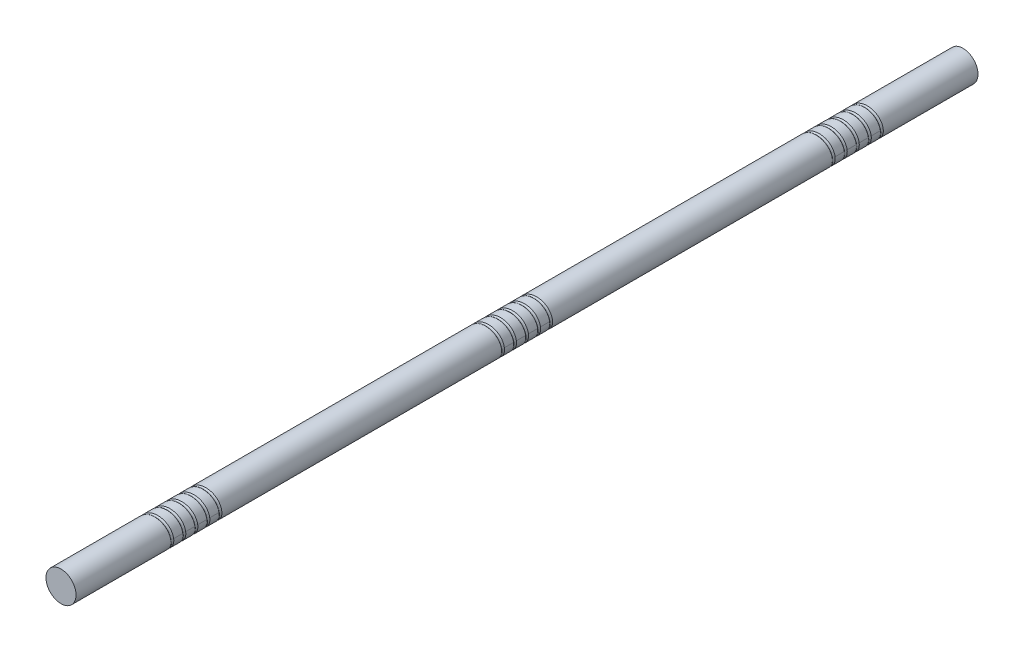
from build123d import *

# Parameters (mm, degrees)
SKETCH1_R              = 25
BOSS_EXTRUDE1_DEPTH    = 1500
CUT_SWEEP1_PITCH       = 20
CUT_SWEEP1_HEIGHT      = 100
CUT_SWEEP1_RADIUS      = 27.116666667
CUT_SWEEP1_START_ANGLE = -180
SKETCH3_R              = 3.175
LPATTERN1_COUNT        = 3
LPATTERN1_PITCH        = 550


with BuildPart() as part:
    # Sketch1 → Boss-Extrude1 (new body)
    with BuildSketch(Plane.XY):
        Circle(SKETCH1_R)
    extrude(amount=BOSS_EXTRUDE1_DEPTH)

    # Cut-Sweep1: sweep along a helix
    with BuildLine() as cut_sweep1_path:
        add(Helix(CUT_SWEEP1_PITCH, CUT_SWEEP1_HEIGHT, CUT_SWEEP1_RADIUS, center=(0, 0, 150), direction=(0, 0, 1), mode=Mode.PRIVATE).rotate(Axis((0, 0, 150), (0, 0, 1)), CUT_SWEEP1_START_ANGLE))
    # Sketch3 → Cut-Sweep1 (sweep, cut)
    with BuildSketch(Plane(origin=(0, 0, 0), x_dir=(1, 0, 0), z_dir=(0, 1, 0))):
        with Locations((-27.116666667, -150)):
            Circle(SKETCH3_R)
    cut_sweep1 = sweep(path=cut_sweep1_path.line, is_frenet=True, mode=Mode.SUBTRACT)

    # LPattern1: Cut-Sweep1 ×3
    with Locations(*[(0, 0, i * LPATTERN1_PITCH) for i in range(1, LPATTERN1_COUNT)]):
        add(cut_sweep1, mode=Mode.SUBTRACT)


solid = part.part
